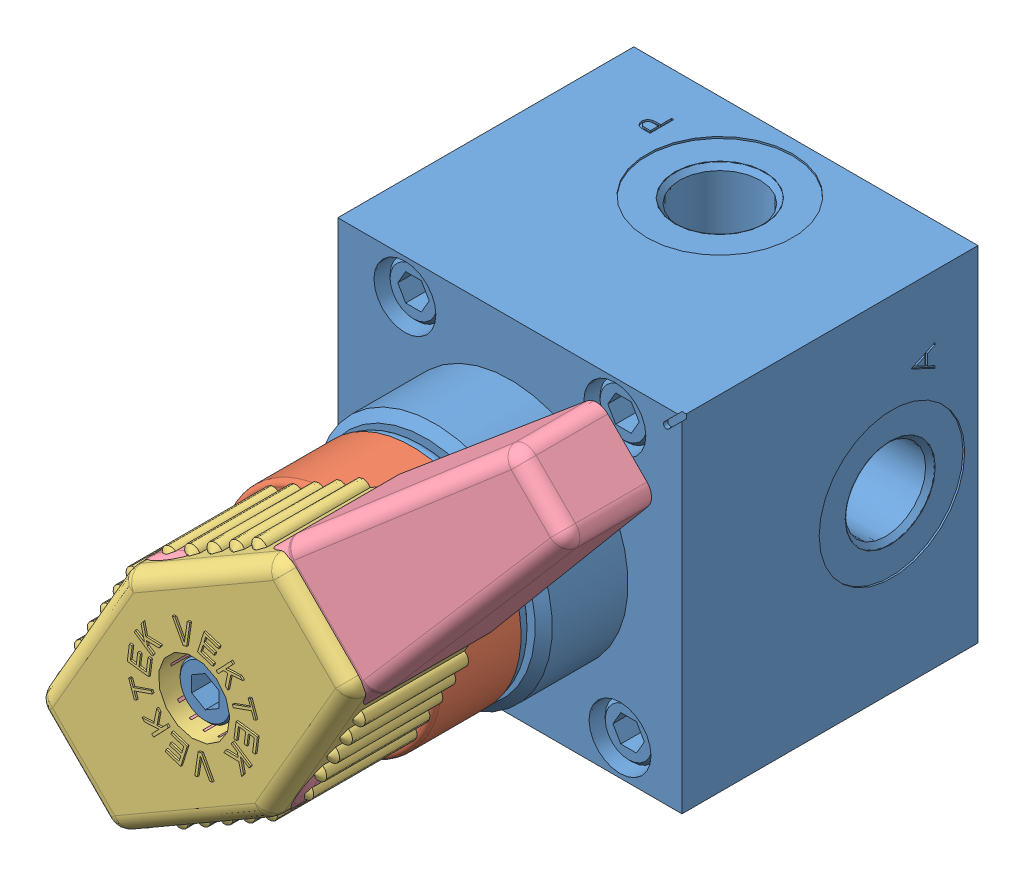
SolidWorks assembly ILCMV47114225.SLDASM, configuration Default (file format 5000). Lengths in mm.
Overall size (59.31 58.16 90.87).
4 component instances, 4 part files, 9 mates.
Components (placement in the parent):
- ILCMV47114225_BASE-1: ILCMV47114225_BASE.sldprt [Default] at (-57.4015 -8.577 -10.7858) size (55.63 50.8 88.65)
- ILCMV47114225_ADAPTER-1: ILCMV47114225_ADAPTER.sldprt [Default] at (-82.8015 16.823 68.5892) x (0 0 -1) z (0.707107 0.707107 0) size (22.23 32.26 32.26)
- 85600903-1: 85600903.sldprt [Default] at (-82.8015 16.823 79.5112) x (0.707107 0.707107 0) z (0.707107 -0.707107 0) size (51.61 19.62 30.64)
- 85600902-1: 85600902.SLDPRT [Default] at (-82.8015 16.823 60.4612) x (0 0 1) z (0.707107 -0.707107 0) size (17.76 89.76 30.23) (hidden)
Mates (geometry in assembly coordinates):
- Concentric1: concentric anti-aligned: cylinder of ILCMV47114225_BASE-1 through (-82.8015 16.823 78.5777) axis (0 0 -1) radius 3.9624; cylinder of ILCMV47114225_ADAPTER-1 through (-82.8015 16.823 40.2846) axis (0 0 1) radius 6.35
- Coincident1: coincident anti-aligned: plane of ILCMV47114225_BASE-1 through (-82.8015 16.823 46.3642) normal (0 0 1); plane of ILCMV47114225_ADAPTER-1 through (-82.8015 16.823 46.3642) normal (0 0 -1)
- Parallel1: parallel aligned: plane of ILCMV47114225_BASE-1 through (-59.37 39.6195 32.9022) normal (-0.707107 0.707107 0); plane of ILCMV47114225_ADAPTER-1 through (-93.7997 21.3786 68.5892) normal (-0.707107 0.707107 0)
- Concentric2: concentric anti-aligned: cylinder of ILCMV47114225_BASE-1 through (-82.8015 16.823 78.5777) axis (0 0 -1) radius 3.9624; cylinder of 85600903-1 through (-82.8015 16.823 51.2146) axis (0 0 1) radius 5.2705
- Parallel2: parallel anti-aligned: plane of ILCMV47114225_ADAPTER-1 through (-93.7997 21.3786 68.5892) normal (-0.707107 0.707107 0); plane of 85600903-1 through (-93.9775 21.4523 60.4612) normal (0.707107 -0.707107 0)
- Coincident5: coincident anti-aligned: plane of ILCMV47114225_ADAPTER-1 through (-82.8015 16.823 68.5892) normal (0 0 1); plane of 85600903-1 through (-82.8015 16.823 68.5892) normal (0 0 -1)
- Concentric3: concentric anti-aligned: cylinder of ILCMV47114225_BASE-1 through (-82.8015 16.823 78.5777) axis (0 0 -1) radius 3.9624; cylinder of 85600902-1 through (-82.8015 16.823 64.3982) axis (0 0 1) radius 5.2705
- Parallel3: parallel anti-aligned: plane of 85600902-1 through (-93.9775 21.4523 60.4612) normal (0.707107 -0.707107 0); plane of ILCMV47114225_ADAPTER-1 through (-93.7997 21.3786 68.5892) normal (-0.707107 0.707107 0)
- Coincident7: coincident anti-aligned: plane of ILCMV47114225_ADAPTER-1 through (-82.8015 16.823 68.5892) normal (0 0 1); plane of 85600902-1 through (-82.8015 16.823 68.5892) normal (0 0 -1)
